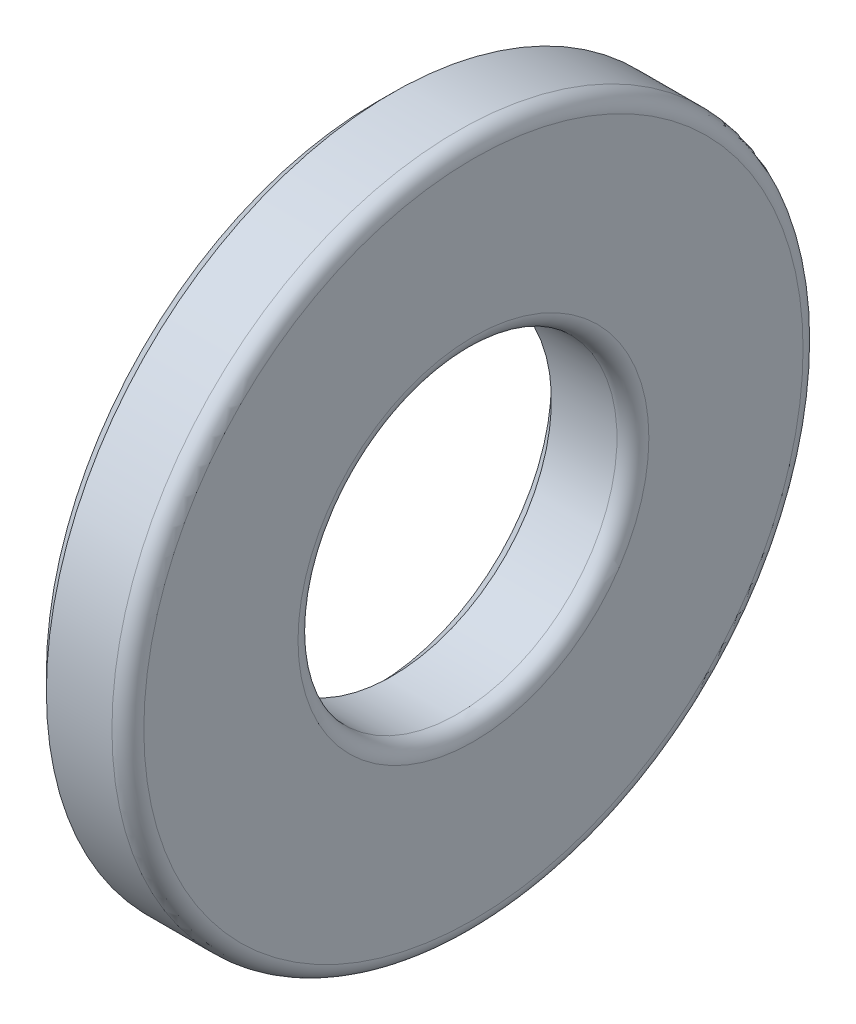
ISO-10303-21;
HEADER;
FILE_DESCRIPTION(('STEP AP214'),'2;1');
FILE_NAME('part.step','',(''),(''),'','','');
FILE_SCHEMA(('AUTOMOTIVE_DESIGN { 1 0 10303 214 1 1 1 1 }'));
ENDSEC;
DATA;
#1=APPLICATION_CONTEXT('core data for automotive mechanical design processes');
#2=APPLICATION_PROTOCOL_DEFINITION('international standard','automotive_design',2000,#1);
#3=PRODUCT_CONTEXT('',#1,'mechanical');
#4=PRODUCT('Part','Part','',(#3));
#5=PRODUCT_RELATED_PRODUCT_CATEGORY('part','',(#4));
#6=PRODUCT_DEFINITION_FORMATION('','',#4);
#7=PRODUCT_DEFINITION_CONTEXT('part definition',#1,'design');
#8=PRODUCT_DEFINITION('design','',#6,#7);
#9=PRODUCT_DEFINITION_SHAPE('','',#8);
#10=(LENGTH_UNIT() NAMED_UNIT(*) SI_UNIT(.MILLI.,.METRE.));
#11=(NAMED_UNIT(*) PLANE_ANGLE_UNIT() SI_UNIT($,.RADIAN.));
#12=(NAMED_UNIT(*) SI_UNIT($,.STERADIAN.) SOLID_ANGLE_UNIT());
#13=UNCERTAINTY_MEASURE_WITH_UNIT(LENGTH_MEASURE(1.E-05),#10,'distance_accuracy_value','');
#14=(GEOMETRIC_REPRESENTATION_CONTEXT(3) GLOBAL_UNCERTAINTY_ASSIGNED_CONTEXT((#13)) GLOBAL_UNIT_ASSIGNED_CONTEXT((#10,
#11,#12)) REPRESENTATION_CONTEXT('',''));
#15=CARTESIAN_POINT('',(0.,0.,0.));
#16=DIRECTION('',(0.,0.,1.));
#17=DIRECTION('',(1.,0.,0.));
#18=AXIS2_PLACEMENT_3D('',#15,#16,#17);
#19=CARTESIAN_POINT('',(7.33333333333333,0.,0.));
#20=DIRECTION('',(-1.,0.,0.));
#21=DIRECTION('',(0.,0.,1.));
#22=AXIS2_PLACEMENT_3D('',#19,#20,#21);
#23=CONICAL_SURFACE('',#22,6.6,0.785398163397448);
#24=CARTESIAN_POINT('',(7.93333333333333,0.,0.));
#25=DIRECTION('',(-1.,0.,0.));
#26=DIRECTION('',(0.,0.,1.));
#27=AXIS2_PLACEMENT_3D('',#24,#25,#26);
#28=CIRCLE('',#27,6.);
#29=CARTESIAN_POINT('',(7.93333333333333,0.,6.));
#30=VERTEX_POINT('',#29);
#31=EDGE_CURVE('E10',#30,#30,#28,.T.);
#32=ORIENTED_EDGE('',*,*,#31,.F.);
#33=EDGE_LOOP('',(#32));
#34=FACE_BOUND('',#33,.T.);
#35=CARTESIAN_POINT('',(7.33333333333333,0.,0.));
#36=DIRECTION('',(-1.,0.,0.));
#37=DIRECTION('',(0.,0.,1.));
#38=AXIS2_PLACEMENT_3D('',#35,#36,#37);
#39=CIRCLE('',#38,6.6);
#40=CARTESIAN_POINT('',(7.33333333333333,0.,6.6));
#41=VERTEX_POINT('',#40);
#42=EDGE_CURVE('E48',#41,#41,#39,.T.);
#43=ORIENTED_EDGE('',*,*,#42,.T.);
#44=EDGE_LOOP('',(#43));
#45=FACE_BOUND('',#44,.T.);
#46=ADVANCED_FACE('F14',(#34,#45),#23,.F.);
#47=CARTESIAN_POINT('',(0.,0.,0.));
#48=DIRECTION('',(-1.,0.,0.));
#49=DIRECTION('',(0.,0.,1.));
#50=AXIS2_PLACEMENT_3D('',#47,#48,#49);
#51=CYLINDRICAL_SURFACE('',#50,6.);
#52=CARTESIAN_POINT('',(10.4,0.,0.));
#53=DIRECTION('',(-1.,0.,0.));
#54=DIRECTION('',(0.,0.,1.));
#55=AXIS2_PLACEMENT_3D('',#52,#53,#54);
#56=CIRCLE('',#55,6.);
#57=CARTESIAN_POINT('',(10.4,0.,6.));
#58=VERTEX_POINT('',#57);
#59=EDGE_CURVE('E20',#58,#58,#56,.T.);
#60=ORIENTED_EDGE('',*,*,#59,.F.);
#61=EDGE_LOOP('',(#60));
#62=FACE_BOUND('',#61,.T.);
#63=ORIENTED_EDGE('',*,*,#31,.T.);
#64=EDGE_LOOP('',(#63));
#65=FACE_BOUND('',#64,.T.);
#66=ADVANCED_FACE('F72',(#62,#65),#51,.F.);
#67=CARTESIAN_POINT('',(10.4,0.,0.));
#68=DIRECTION('',(-1.,0.,0.));
#69=DIRECTION('',(0.,0.,1.));
#70=AXIS2_PLACEMENT_3D('',#67,#68,#69);
#71=TOROIDAL_SURFACE('',#70,6.6,0.6);
#72=CARTESIAN_POINT('',(11.,0.,0.));
#73=DIRECTION('',(-1.,0.,0.));
#74=DIRECTION('',(0.,0.,1.));
#75=AXIS2_PLACEMENT_3D('',#72,#73,#74);
#76=CIRCLE('',#75,6.6);
#77=CARTESIAN_POINT('',(11.,0.,6.6));
#78=VERTEX_POINT('',#77);
#79=EDGE_CURVE('E24',#78,#78,#76,.T.);
#80=ORIENTED_EDGE('',*,*,#79,.F.);
#81=EDGE_LOOP('',(#80));
#82=FACE_BOUND('',#81,.T.);
#83=ORIENTED_EDGE('',*,*,#59,.T.);
#84=EDGE_LOOP('',(#83));
#85=FACE_BOUND('',#84,.T.);
#86=ADVANCED_FACE('F78',(#82,#85),#71,.T.);
#87=CARTESIAN_POINT('',(11.,6.6,0.));
#88=DIRECTION('',(-1.,0.,0.));
#89=DIRECTION('',(0.,0.,1.));
#90=AXIS2_PLACEMENT_3D('',#87,#88,#89);
#91=PLANE('',#90);
#92=CARTESIAN_POINT('',(11.,0.,0.));
#93=DIRECTION('',(-1.,0.,0.));
#94=DIRECTION('',(0.,0.,1.));
#95=AXIS2_PLACEMENT_3D('',#92,#93,#94);
#96=CIRCLE('',#95,12.4);
#97=CARTESIAN_POINT('',(11.,0.,12.4));
#98=VERTEX_POINT('',#97);
#99=EDGE_CURVE('E28',#98,#98,#96,.T.);
#100=ORIENTED_EDGE('',*,*,#99,.F.);
#101=EDGE_LOOP('',(#100));
#102=FACE_BOUND('',#101,.T.);
#103=ORIENTED_EDGE('',*,*,#79,.T.);
#104=EDGE_LOOP('',(#103));
#105=FACE_BOUND('',#104,.T.);
#106=ADVANCED_FACE('F85',(#102,#105),#91,.F.);
#107=CARTESIAN_POINT('',(10.4,0.,0.));
#108=DIRECTION('',(-1.,0.,0.));
#109=DIRECTION('',(0.,0.,1.));
#110=AXIS2_PLACEMENT_3D('',#107,#108,#109);
#111=TOROIDAL_SURFACE('',#110,12.4,0.6);
#112=CARTESIAN_POINT('',(10.4,0.,0.));
#113=DIRECTION('',(-1.,0.,0.));
#114=DIRECTION('',(0.,0.,1.));
#115=AXIS2_PLACEMENT_3D('',#112,#113,#114);
#116=CIRCLE('',#115,13.);
#117=CARTESIAN_POINT('',(10.4,0.,13.));
#118=VERTEX_POINT('',#117);
#119=EDGE_CURVE('E33',#118,#118,#116,.T.);
#120=ORIENTED_EDGE('',*,*,#119,.F.);
#121=EDGE_LOOP('',(#120));
#122=FACE_BOUND('',#121,.T.);
#123=ORIENTED_EDGE('',*,*,#99,.T.);
#124=EDGE_LOOP('',(#123));
#125=FACE_BOUND('',#124,.T.);
#126=ADVANCED_FACE('F90',(#122,#125),#111,.T.);
#127=CARTESIAN_POINT('',(0.,0.,0.));
#128=DIRECTION('',(-1.,0.,0.));
#129=DIRECTION('',(0.,0.,1.));
#130=AXIS2_PLACEMENT_3D('',#127,#128,#129);
#131=CYLINDRICAL_SURFACE('',#130,13.);
#132=CARTESIAN_POINT('',(7.93333333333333,0.,0.));
#133=DIRECTION('',(-1.,0.,0.));
#134=DIRECTION('',(0.,0.,1.));
#135=AXIS2_PLACEMENT_3D('',#132,#133,#134);
#136=CIRCLE('',#135,13.);
#137=CARTESIAN_POINT('',(7.93333333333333,0.,13.));
#138=VERTEX_POINT('',#137);
#139=EDGE_CURVE('E36',#138,#138,#136,.T.);
#140=ORIENTED_EDGE('',*,*,#139,.F.);
#141=EDGE_LOOP('',(#140));
#142=FACE_BOUND('',#141,.T.);
#143=ORIENTED_EDGE('',*,*,#119,.T.);
#144=EDGE_LOOP('',(#143));
#145=FACE_BOUND('',#144,.T.);
#146=ADVANCED_FACE('F94',(#142,#145),#131,.T.);
#147=CARTESIAN_POINT('',(7.93333333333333,0.,0.));
#148=DIRECTION('',(1.,0.,0.));
#149=DIRECTION('',(0.,0.,-1.));
#150=AXIS2_PLACEMENT_3D('',#147,#148,#149);
#151=CONICAL_SURFACE('',#150,13.,0.785398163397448);
#152=CARTESIAN_POINT('',(7.33333333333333,0.,0.));
#153=DIRECTION('',(-1.,0.,0.));
#154=DIRECTION('',(0.,0.,1.));
#155=AXIS2_PLACEMENT_3D('',#152,#153,#154);
#156=CIRCLE('',#155,12.4);
#157=CARTESIAN_POINT('',(7.33333333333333,0.,12.4));
#158=VERTEX_POINT('',#157);
#159=EDGE_CURVE('E39',#158,#158,#156,.T.);
#160=ORIENTED_EDGE('',*,*,#159,.F.);
#161=EDGE_LOOP('',(#160));
#162=FACE_BOUND('',#161,.T.);
#163=ORIENTED_EDGE('',*,*,#139,.T.);
#164=EDGE_LOOP('',(#163));
#165=FACE_BOUND('',#164,.T.);
#166=ADVANCED_FACE('F68',(#162,#165),#151,.T.);
#167=CARTESIAN_POINT('',(7.33333333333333,12.4,0.));
#168=DIRECTION('',(1.,0.,0.));
#169=DIRECTION('',(0.,0.,-1.));
#170=AXIS2_PLACEMENT_3D('',#167,#168,#169);
#171=PLANE('',#170);
#172=CARTESIAN_POINT('',(7.33333333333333,0.,0.));
#173=DIRECTION('',(-1.,0.,0.));
#174=DIRECTION('',(0.,0.,1.));
#175=AXIS2_PLACEMENT_3D('',#172,#173,#174);
#176=CIRCLE('',#175,11.0497289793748);
#177=CARTESIAN_POINT('',(7.33333333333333,0.,11.0497289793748));
#178=VERTEX_POINT('',#177);
#179=EDGE_CURVE('E42',#178,#178,#176,.T.);
#180=ORIENTED_EDGE('',*,*,#179,.F.);
#181=EDGE_LOOP('',(#180));
#182=FACE_BOUND('',#181,.T.);
#183=ORIENTED_EDGE('',*,*,#159,.T.);
#184=EDGE_LOOP('',(#183));
#185=FACE_BOUND('',#184,.T.);
#186=ADVANCED_FACE('F61',(#182,#185),#171,.F.);
#187=CARTESIAN_POINT('',(5.5,0.,0.));
#188=DIRECTION('',(-1.,0.,0.));
#189=DIRECTION('',(0.,0.,1.));
#190=AXIS2_PLACEMENT_3D('',#187,#188,#189);
#191=TOROIDAL_SURFACE('',#190,9.,2.75);
#192=ORIENTED_EDGE('',*,*,#179,.T.);
#193=EDGE_LOOP('',(#192));
#194=FACE_BOUND('',#193,.T.);
#195=CARTESIAN_POINT('',(7.33333333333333,0.,0.));
#196=DIRECTION('',(-1.,0.,0.));
#197=DIRECTION('',(0.,0.,1.));
#198=AXIS2_PLACEMENT_3D('',#195,#196,#197);
#199=CIRCLE('',#198,6.95027102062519);
#200=CARTESIAN_POINT('',(7.33333333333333,0.,6.95027102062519));
#201=VERTEX_POINT('',#200);
#202=EDGE_CURVE('E45',#201,#201,#199,.T.);
#203=ORIENTED_EDGE('',*,*,#202,.F.);
#204=EDGE_LOOP('',(#203));
#205=FACE_BOUND('',#204,.T.);
#206=ADVANCED_FACE('F56',(#194,#205),#191,.F.);
#207=CARTESIAN_POINT('',(7.33333333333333,6.95027102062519,0.));
#208=DIRECTION('',(1.,0.,0.));
#209=DIRECTION('',(0.,0.,-1.));
#210=AXIS2_PLACEMENT_3D('',#207,#208,#209);
#211=PLANE('',#210);
#212=ORIENTED_EDGE('',*,*,#42,.F.);
#213=EDGE_LOOP('',(#212));
#214=FACE_BOUND('',#213,.T.);
#215=ORIENTED_EDGE('',*,*,#202,.T.);
#216=EDGE_LOOP('',(#215));
#217=FACE_BOUND('',#216,.T.);
#218=ADVANCED_FACE('F53',(#214,#217),#211,.F.);
#219=CLOSED_SHELL('',(#46,#66,#86,#106,#126,#146,#166,#186,#206,#218));
#220=MANIFOLD_SOLID_BREP('B1',#219);
#221=ADVANCED_BREP_SHAPE_REPRESENTATION('',(#18,#220),#14);
#222=SHAPE_DEFINITION_REPRESENTATION(#9,#221);
ENDSEC;
END-ISO-10303-21;
